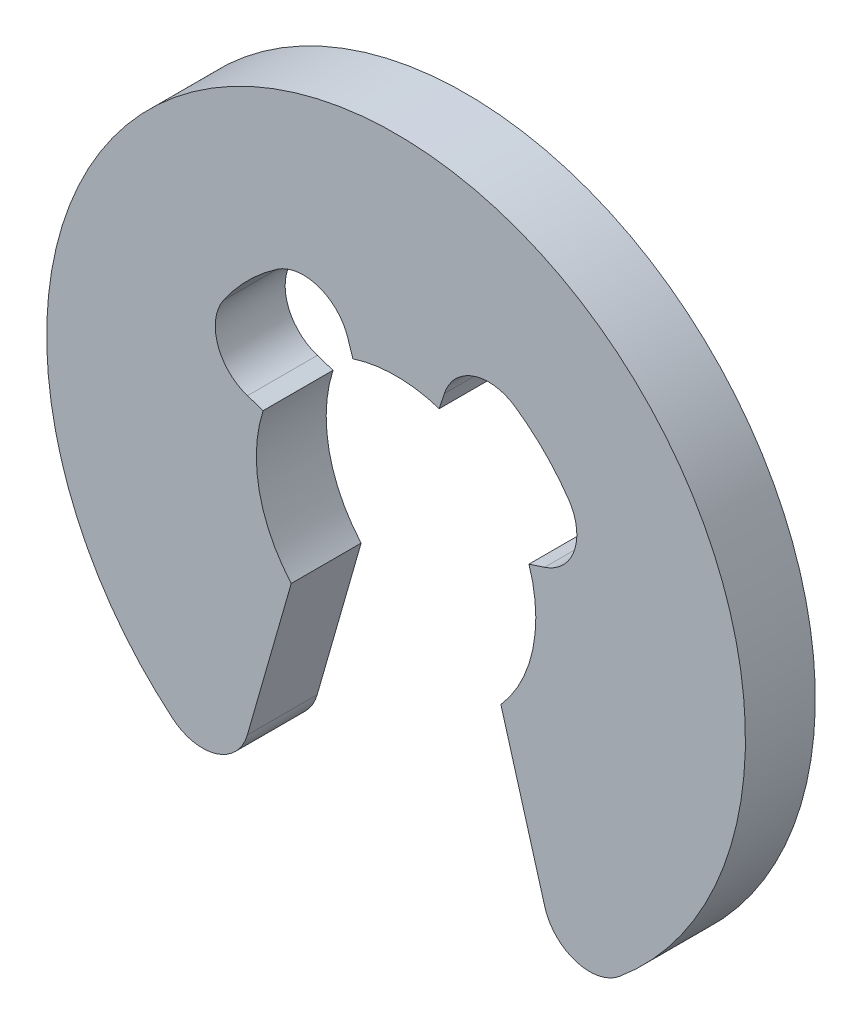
ISO-10303-21;
HEADER;
FILE_DESCRIPTION(('STEP AP214'),'2;1');
FILE_NAME('part.step','',(''),(''),'','','');
FILE_SCHEMA(('AUTOMOTIVE_DESIGN { 1 0 10303 214 1 1 1 1 }'));
ENDSEC;
DATA;
#1=APPLICATION_CONTEXT('core data for automotive mechanical design processes');
#2=APPLICATION_PROTOCOL_DEFINITION('international standard','automotive_design',2000,#1);
#3=PRODUCT_CONTEXT('',#1,'mechanical');
#4=PRODUCT('Part','Part','',(#3));
#5=PRODUCT_RELATED_PRODUCT_CATEGORY('part','',(#4));
#6=PRODUCT_DEFINITION_FORMATION('','',#4);
#7=PRODUCT_DEFINITION_CONTEXT('part definition',#1,'design');
#8=PRODUCT_DEFINITION('design','',#6,#7);
#9=PRODUCT_DEFINITION_SHAPE('','',#8);
#10=(LENGTH_UNIT() NAMED_UNIT(*) SI_UNIT(.MILLI.,.METRE.));
#11=(NAMED_UNIT(*) PLANE_ANGLE_UNIT() SI_UNIT($,.RADIAN.));
#12=(NAMED_UNIT(*) SI_UNIT($,.STERADIAN.) SOLID_ANGLE_UNIT());
#13=UNCERTAINTY_MEASURE_WITH_UNIT(LENGTH_MEASURE(1.E-05),#10,'distance_accuracy_value','');
#14=(GEOMETRIC_REPRESENTATION_CONTEXT(3) GLOBAL_UNCERTAINTY_ASSIGNED_CONTEXT((#13)) GLOBAL_UNIT_ASSIGNED_CONTEXT((#10,
#11,#12)) REPRESENTATION_CONTEXT('',''));
#15=CARTESIAN_POINT('',(0.,0.,0.));
#16=DIRECTION('',(0.,0.,1.));
#17=DIRECTION('',(1.,0.,0.));
#18=AXIS2_PLACEMENT_3D('',#15,#16,#17);
#19=CARTESIAN_POINT('',(0.57618470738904,0.397506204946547,-0.3));
#20=DIRECTION('',(0.,0.,1.));
#21=DIRECTION('',(1.,0.,0.));
#22=AXIS2_PLACEMENT_3D('',#19,#20,#21);
#23=CYLINDRICAL_SURFACE('',#22,0.2);
#24=CARTESIAN_POINT('',(0.57618470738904,0.397506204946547,0.));
#25=DIRECTION('',(0.,0.,-1.));
#26=DIRECTION('',(-1.,0.,0.));
#27=AXIS2_PLACEMENT_3D('',#24,#25,#26);
#28=CIRCLE('',#27,0.2);
#29=CARTESIAN_POINT('',(0.740808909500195,0.511079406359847,0.));
#30=VERTEX_POINT('',#29);
#31=CARTESIAN_POINT('',(0.63798810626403,0.207294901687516,0.));
#32=VERTEX_POINT('',#31);
#33=EDGE_CURVE('E190',#30,#32,#28,.T.);
#34=ORIENTED_EDGE('',*,*,#33,.F.);
#35=DIRECTION('',(0.,0.,1.));
#36=VECTOR('',#35,1.);
#37=CARTESIAN_POINT('',(0.740808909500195,0.511079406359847,-0.3));
#38=LINE('',#37,#36);
#39=CARTESIAN_POINT('',(0.740808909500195,0.511079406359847,-0.3));
#40=VERTEX_POINT('',#39);
#41=EDGE_CURVE('E11',#40,#30,#38,.T.);
#42=ORIENTED_EDGE('',*,*,#41,.F.);
#43=CARTESIAN_POINT('',(0.57618470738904,0.397506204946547,-0.3));
#44=DIRECTION('',(0.,0.,-1.));
#45=DIRECTION('',(-1.,0.,0.));
#46=AXIS2_PLACEMENT_3D('',#43,#44,#45);
#47=CIRCLE('',#46,0.2);
#48=CARTESIAN_POINT('',(0.63798810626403,0.207294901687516,-0.3));
#49=VERTEX_POINT('',#48);
#50=EDGE_CURVE('E240',#40,#49,#47,.T.);
#51=ORIENTED_EDGE('',*,*,#50,.T.);
#52=DIRECTION('',(0.,0.,1.));
#53=VECTOR('',#52,1.);
#54=CARTESIAN_POINT('',(0.63798810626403,0.207294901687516,-0.3));
#55=LINE('',#54,#53);
#56=EDGE_CURVE('E36',#49,#32,#55,.T.);
#57=ORIENTED_EDGE('',*,*,#56,.T.);
#58=EDGE_LOOP('',(#34,#42,#51,#57));
#59=FACE_BOUND('',#58,.T.);
#60=ADVANCED_FACE('F33',(#59),#23,.F.);
#61=CARTESIAN_POINT('',(0.,0.,-0.3));
#62=DIRECTION('',(0.,0.,1.));
#63=DIRECTION('',(1.,0.,0.));
#64=AXIS2_PLACEMENT_3D('',#61,#62,#63);
#65=CYLINDRICAL_SURFACE('',#64,0.900000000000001);
#66=CARTESIAN_POINT('',(0.,0.,0.));
#67=DIRECTION('',(0.,0.,-1.));
#68=DIRECTION('',(1.,0.,0.));
#69=AXIS2_PLACEMENT_3D('',#66,#67,#68);
#70=CIRCLE('',#69,0.900000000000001);
#71=CARTESIAN_POINT('',(0.511079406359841,0.740808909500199,0.));
#72=VERTEX_POINT('',#71);
#73=EDGE_CURVE('E238',#72,#30,#70,.T.);
#74=ORIENTED_EDGE('',*,*,#73,.F.);
#75=DIRECTION('',(0.,0.,1.));
#76=VECTOR('',#75,1.);
#77=CARTESIAN_POINT('',(0.511079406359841,0.740808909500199,-0.3));
#78=LINE('',#77,#76);
#79=CARTESIAN_POINT('',(0.511079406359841,0.740808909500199,-0.3));
#80=VERTEX_POINT('',#79);
#81=EDGE_CURVE('E42',#80,#72,#78,.T.);
#82=ORIENTED_EDGE('',*,*,#81,.F.);
#83=CARTESIAN_POINT('',(0.,0.,-0.3));
#84=DIRECTION('',(0.,0.,-1.));
#85=DIRECTION('',(1.,0.,0.));
#86=AXIS2_PLACEMENT_3D('',#83,#84,#85);
#87=CIRCLE('',#86,0.900000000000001);
#88=EDGE_CURVE('E180',#80,#40,#87,.T.);
#89=ORIENTED_EDGE('',*,*,#88,.T.);
#90=ORIENTED_EDGE('',*,*,#41,.T.);
#91=EDGE_LOOP('',(#74,#82,#89,#90));
#92=FACE_BOUND('',#91,.T.);
#93=ADVANCED_FACE('F272',(#92),#65,.F.);
#94=CARTESIAN_POINT('',(0.397506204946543,0.576184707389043,-0.3));
#95=DIRECTION('',(0.,0.,1.));
#96=DIRECTION('',(1.,0.,0.));
#97=AXIS2_PLACEMENT_3D('',#94,#95,#96);
#98=CYLINDRICAL_SURFACE('',#97,0.2);
#99=CARTESIAN_POINT('',(0.397506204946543,0.576184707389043,0.));
#100=DIRECTION('',(0.,0.,-1.));
#101=DIRECTION('',(-1.,0.,0.));
#102=AXIS2_PLACEMENT_3D('',#99,#100,#101);
#103=CIRCLE('',#102,0.2);
#104=CARTESIAN_POINT('',(0.207294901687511,0.637988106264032,0.));
#105=VERTEX_POINT('',#104);
#106=EDGE_CURVE('E167',#105,#72,#103,.T.);
#107=ORIENTED_EDGE('',*,*,#106,.F.);
#108=DIRECTION('',(0.,0.,1.));
#109=VECTOR('',#108,1.);
#110=CARTESIAN_POINT('',(0.207294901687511,0.637988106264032,-0.3));
#111=LINE('',#110,#109);
#112=CARTESIAN_POINT('',(0.207294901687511,0.637988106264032,-0.3));
#113=VERTEX_POINT('',#112);
#114=EDGE_CURVE('E162',#113,#105,#111,.T.);
#115=ORIENTED_EDGE('',*,*,#114,.F.);
#116=CARTESIAN_POINT('',(0.397506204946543,0.576184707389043,-0.3));
#117=DIRECTION('',(0.,0.,-1.));
#118=DIRECTION('',(-1.,0.,0.));
#119=AXIS2_PLACEMENT_3D('',#116,#117,#118);
#120=CIRCLE('',#119,0.2);
#121=EDGE_CURVE('E165',#113,#80,#120,.T.);
#122=ORIENTED_EDGE('',*,*,#121,.T.);
#123=ORIENTED_EDGE('',*,*,#81,.T.);
#124=EDGE_LOOP('',(#107,#115,#122,#123));
#125=FACE_BOUND('',#124,.T.);
#126=ADVANCED_FACE('F164',(#125),#98,.F.);
#127=CARTESIAN_POINT('',(0.207294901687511,0.637988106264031,-0.3));
#128=DIRECTION('',(0.951056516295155,-0.309016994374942,0.));
#129=DIRECTION('',(0.309016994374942,0.951056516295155,0.));
#130=AXIS2_PLACEMENT_3D('',#127,#128,#129);
#131=PLANE('',#130);
#132=DIRECTION('',(0.309016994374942,0.951056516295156,0.));
#133=VECTOR('',#132,1.);
#134=CARTESIAN_POINT('',(0.207294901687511,0.637988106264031,0.));
#135=LINE('',#134,#133);
#136=CARTESIAN_POINT('',(0.185410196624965,0.570633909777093,0.));
#137=VERTEX_POINT('',#136);
#138=EDGE_CURVE('E235',#137,#105,#135,.T.);
#139=ORIENTED_EDGE('',*,*,#138,.F.);
#140=DIRECTION('',(0.,0.,1.));
#141=VECTOR('',#140,1.);
#142=CARTESIAN_POINT('',(0.185410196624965,0.570633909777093,-0.3));
#143=LINE('',#142,#141);
#144=CARTESIAN_POINT('',(0.185410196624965,0.570633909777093,-0.3));
#145=VERTEX_POINT('',#144);
#146=EDGE_CURVE('E172',#145,#137,#143,.T.);
#147=ORIENTED_EDGE('',*,*,#146,.F.);
#148=DIRECTION('',(0.309016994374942,0.951056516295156,0.));
#149=VECTOR('',#148,1.);
#150=CARTESIAN_POINT('',(0.207294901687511,0.637988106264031,-0.3));
#151=LINE('',#150,#149);
#152=EDGE_CURVE('E178',#145,#113,#151,.T.);
#153=ORIENTED_EDGE('',*,*,#152,.T.);
#154=ORIENTED_EDGE('',*,*,#114,.T.);
#155=EDGE_LOOP('',(#139,#147,#153,#154));
#156=FACE_BOUND('',#155,.T.);
#157=ADVANCED_FACE('F182',(#156),#131,.T.);
#158=CARTESIAN_POINT('',(0.,0.,-0.3));
#159=DIRECTION('',(0.,0.,1.));
#160=DIRECTION('',(1.,0.,0.));
#161=AXIS2_PLACEMENT_3D('',#158,#159,#160);
#162=CYLINDRICAL_SURFACE('',#161,0.6);
#163=CARTESIAN_POINT('',(0.,0.,0.));
#164=DIRECTION('',(0.,0.,-1.));
#165=DIRECTION('',(1.,0.,0.));
#166=AXIS2_PLACEMENT_3D('',#163,#164,#165);
#167=CIRCLE('',#166,0.6);
#168=CARTESIAN_POINT('',(-0.185410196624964,0.570633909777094,0.));
#169=VERTEX_POINT('',#168);
#170=EDGE_CURVE('E232',#169,#137,#167,.T.);
#171=ORIENTED_EDGE('',*,*,#170,.F.);
#172=DIRECTION('',(0.,0.,1.));
#173=VECTOR('',#172,1.);
#174=CARTESIAN_POINT('',(-0.185410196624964,0.570633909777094,-0.3));
#175=LINE('',#174,#173);
#176=CARTESIAN_POINT('',(-0.185410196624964,0.570633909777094,-0.3));
#177=VERTEX_POINT('',#176);
#178=EDGE_CURVE('E244',#177,#169,#175,.T.);
#179=ORIENTED_EDGE('',*,*,#178,.F.);
#180=CARTESIAN_POINT('',(0.,0.,-0.3));
#181=DIRECTION('',(0.,0.,-1.));
#182=DIRECTION('',(1.,0.,0.));
#183=AXIS2_PLACEMENT_3D('',#180,#181,#182);
#184=CIRCLE('',#183,0.6);
#185=EDGE_CURVE('E183',#177,#145,#184,.T.);
#186=ORIENTED_EDGE('',*,*,#185,.T.);
#187=ORIENTED_EDGE('',*,*,#146,.T.);
#188=EDGE_LOOP('',(#171,#179,#186,#187));
#189=FACE_BOUND('',#188,.T.);
#190=ADVANCED_FACE('F285',(#189),#162,.F.);
#191=CARTESIAN_POINT('',(-0.207294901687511,0.637988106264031,-0.3));
#192=DIRECTION('',(-0.951056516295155,-0.309016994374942,0.));
#193=DIRECTION('',(0.309016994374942,-0.951056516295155,0.));
#194=AXIS2_PLACEMENT_3D('',#191,#192,#193);
#195=PLANE('',#194);
#196=DIRECTION('',(0.309016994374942,-0.951056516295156,0.));
#197=VECTOR('',#196,1.);
#198=CARTESIAN_POINT('',(-0.207294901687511,0.637988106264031,0.));
#199=LINE('',#198,#197);
#200=CARTESIAN_POINT('',(-0.207294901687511,0.637988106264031,0.));
#201=VERTEX_POINT('',#200);
#202=EDGE_CURVE('E229',#201,#169,#199,.T.);
#203=ORIENTED_EDGE('',*,*,#202,.F.);
#204=DIRECTION('',(0.,0.,1.));
#205=VECTOR('',#204,1.);
#206=CARTESIAN_POINT('',(-0.207294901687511,0.637988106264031,-0.3));
#207=LINE('',#206,#205);
#208=CARTESIAN_POINT('',(-0.207294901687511,0.637988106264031,-0.3));
#209=VERTEX_POINT('',#208);
#210=EDGE_CURVE('E246',#209,#201,#207,.T.);
#211=ORIENTED_EDGE('',*,*,#210,.F.);
#212=DIRECTION('',(0.309016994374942,-0.951056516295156,0.));
#213=VECTOR('',#212,1.);
#214=CARTESIAN_POINT('',(-0.207294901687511,0.637988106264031,-0.3));
#215=LINE('',#214,#213);
#216=EDGE_CURVE('E185',#209,#177,#215,.T.);
#217=ORIENTED_EDGE('',*,*,#216,.T.);
#218=ORIENTED_EDGE('',*,*,#178,.T.);
#219=EDGE_LOOP('',(#203,#211,#217,#218));
#220=FACE_BOUND('',#219,.T.);
#221=ADVANCED_FACE('F288',(#220),#195,.T.);
#222=CARTESIAN_POINT('',(-0.397506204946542,0.576184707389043,-0.3));
#223=DIRECTION('',(0.,0.,1.));
#224=DIRECTION('',(1.,0.,0.));
#225=AXIS2_PLACEMENT_3D('',#222,#223,#224);
#226=CYLINDRICAL_SURFACE('',#225,0.2);
#227=CARTESIAN_POINT('',(-0.397506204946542,0.576184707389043,0.));
#228=DIRECTION('',(0.,0.,-1.));
#229=DIRECTION('',(1.,0.,0.));
#230=AXIS2_PLACEMENT_3D('',#227,#228,#229);
#231=CIRCLE('',#230,0.2);
#232=CARTESIAN_POINT('',(-0.51107940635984,0.740808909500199,0.));
#233=VERTEX_POINT('',#232);
#234=EDGE_CURVE('E226',#233,#201,#231,.T.);
#235=ORIENTED_EDGE('',*,*,#234,.F.);
#236=DIRECTION('',(0.,0.,1.));
#237=VECTOR('',#236,1.);
#238=CARTESIAN_POINT('',(-0.51107940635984,0.740808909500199,-0.3));
#239=LINE('',#238,#237);
#240=CARTESIAN_POINT('',(-0.51107940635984,0.740808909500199,-0.3));
#241=VERTEX_POINT('',#240);
#242=EDGE_CURVE('E248',#241,#233,#239,.T.);
#243=ORIENTED_EDGE('',*,*,#242,.F.);
#244=CARTESIAN_POINT('',(-0.397506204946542,0.576184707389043,-0.3));
#245=DIRECTION('',(0.,0.,-1.));
#246=DIRECTION('',(1.,0.,0.));
#247=AXIS2_PLACEMENT_3D('',#244,#245,#246);
#248=CIRCLE('',#247,0.2);
#249=EDGE_CURVE('E496',#241,#209,#248,.T.);
#250=ORIENTED_EDGE('',*,*,#249,.T.);
#251=ORIENTED_EDGE('',*,*,#210,.T.);
#252=EDGE_LOOP('',(#235,#243,#250,#251));
#253=FACE_BOUND('',#252,.T.);
#254=ADVANCED_FACE('F292',(#253),#226,.F.);
#255=CARTESIAN_POINT('',(0.,0.,-0.3));
#256=DIRECTION('',(0.,0.,1.));
#257=DIRECTION('',(1.,0.,0.));
#258=AXIS2_PLACEMENT_3D('',#255,#256,#257);
#259=CYLINDRICAL_SURFACE('',#258,0.9);
#260=CARTESIAN_POINT('',(0.,0.,0.));
#261=DIRECTION('',(0.,0.,-1.));
#262=DIRECTION('',(-1.,0.,0.));
#263=AXIS2_PLACEMENT_3D('',#260,#261,#262);
#264=CIRCLE('',#263,0.9);
#265=CARTESIAN_POINT('',(-0.740808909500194,0.511079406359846,0.));
#266=VERTEX_POINT('',#265);
#267=EDGE_CURVE('E223',#266,#233,#264,.T.);
#268=ORIENTED_EDGE('',*,*,#267,.F.);
#269=DIRECTION('',(0.,0.,1.));
#270=VECTOR('',#269,1.);
#271=CARTESIAN_POINT('',(-0.740808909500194,0.511079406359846,-0.3));
#272=LINE('',#271,#270);
#273=CARTESIAN_POINT('',(-0.740808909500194,0.511079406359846,-0.3));
#274=VERTEX_POINT('',#273);
#275=EDGE_CURVE('E250',#274,#266,#272,.T.);
#276=ORIENTED_EDGE('',*,*,#275,.F.);
#277=CARTESIAN_POINT('',(0.,0.,-0.3));
#278=DIRECTION('',(0.,0.,-1.));
#279=DIRECTION('',(-1.,0.,0.));
#280=AXIS2_PLACEMENT_3D('',#277,#278,#279);
#281=CIRCLE('',#280,0.9);
#282=EDGE_CURVE('E500',#274,#241,#281,.T.);
#283=ORIENTED_EDGE('',*,*,#282,.T.);
#284=ORIENTED_EDGE('',*,*,#242,.T.);
#285=EDGE_LOOP('',(#268,#276,#283,#284));
#286=FACE_BOUND('',#285,.T.);
#287=ADVANCED_FACE('F296',(#286),#259,.F.);
#288=CARTESIAN_POINT('',(-0.57618470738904,0.397506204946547,-0.3));
#289=DIRECTION('',(0.,0.,1.));
#290=DIRECTION('',(1.,0.,0.));
#291=AXIS2_PLACEMENT_3D('',#288,#289,#290);
#292=CYLINDRICAL_SURFACE('',#291,0.2);
#293=CARTESIAN_POINT('',(-0.57618470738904,0.397506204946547,0.));
#294=DIRECTION('',(0.,0.,-1.));
#295=DIRECTION('',(1.,0.,0.));
#296=AXIS2_PLACEMENT_3D('',#293,#294,#295);
#297=CIRCLE('',#296,0.2);
#298=CARTESIAN_POINT('',(-0.637988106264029,0.207294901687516,0.));
#299=VERTEX_POINT('',#298);
#300=EDGE_CURVE('E220',#299,#266,#297,.T.);
#301=ORIENTED_EDGE('',*,*,#300,.F.);
#302=DIRECTION('',(0.,0.,1.));
#303=VECTOR('',#302,1.);
#304=CARTESIAN_POINT('',(-0.637988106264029,0.207294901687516,-0.3));
#305=LINE('',#304,#303);
#306=CARTESIAN_POINT('',(-0.637988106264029,0.207294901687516,-0.3));
#307=VERTEX_POINT('',#306);
#308=EDGE_CURVE('E252',#307,#299,#305,.T.);
#309=ORIENTED_EDGE('',*,*,#308,.F.);
#310=CARTESIAN_POINT('',(-0.57618470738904,0.397506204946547,-0.3));
#311=DIRECTION('',(0.,0.,-1.));
#312=DIRECTION('',(1.,0.,0.));
#313=AXIS2_PLACEMENT_3D('',#310,#311,#312);
#314=CIRCLE('',#313,0.2);
#315=EDGE_CURVE('E489',#307,#274,#314,.T.);
#316=ORIENTED_EDGE('',*,*,#315,.T.);
#317=ORIENTED_EDGE('',*,*,#275,.T.);
#318=EDGE_LOOP('',(#301,#309,#316,#317));
#319=FACE_BOUND('',#318,.T.);
#320=ADVANCED_FACE('F300',(#319),#292,.F.);
#321=CARTESIAN_POINT('',(-0.570633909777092,0.185410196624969,-0.3));
#322=DIRECTION('',(0.309016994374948,0.951056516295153,0.));
#323=DIRECTION('',(-0.951056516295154,0.309016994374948,0.));
#324=AXIS2_PLACEMENT_3D('',#321,#322,#323);
#325=PLANE('',#324);
#326=DIRECTION('',(-0.951056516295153,0.309016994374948,0.));
#327=VECTOR('',#326,1.);
#328=CARTESIAN_POINT('',(-0.570633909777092,0.185410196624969,0.));
#329=LINE('',#328,#327);
#330=CARTESIAN_POINT('',(-0.570633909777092,0.185410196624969,0.));
#331=VERTEX_POINT('',#330);
#332=EDGE_CURVE('E217',#331,#299,#329,.T.);
#333=ORIENTED_EDGE('',*,*,#332,.F.);
#334=DIRECTION('',(0.,0.,1.));
#335=VECTOR('',#334,1.);
#336=CARTESIAN_POINT('',(-0.570633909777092,0.185410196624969,-0.3));
#337=LINE('',#336,#335);
#338=CARTESIAN_POINT('',(-0.570633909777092,0.185410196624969,-0.3));
#339=VERTEX_POINT('',#338);
#340=EDGE_CURVE('E254',#339,#331,#337,.T.);
#341=ORIENTED_EDGE('',*,*,#340,.F.);
#342=DIRECTION('',(-0.951056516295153,0.309016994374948,0.));
#343=VECTOR('',#342,1.);
#344=CARTESIAN_POINT('',(-0.570633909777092,0.185410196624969,-0.3));
#345=LINE('',#344,#343);
#346=EDGE_CURVE('E485',#339,#307,#345,.T.);
#347=ORIENTED_EDGE('',*,*,#346,.T.);
#348=ORIENTED_EDGE('',*,*,#308,.T.);
#349=EDGE_LOOP('',(#333,#341,#347,#348));
#350=FACE_BOUND('',#349,.T.);
#351=ADVANCED_FACE('F304',(#350),#325,.T.);
#352=CARTESIAN_POINT('',(0.,0.,-0.3));
#353=DIRECTION('',(0.,0.,1.));
#354=DIRECTION('',(1.,0.,0.));
#355=AXIS2_PLACEMENT_3D('',#352,#353,#354);
#356=CYLINDRICAL_SURFACE('',#355,0.6);
#357=CARTESIAN_POINT('',(0.,0.,0.));
#358=DIRECTION('',(0.,0.,-1.));
#359=DIRECTION('',(-1.,0.,0.));
#360=AXIS2_PLACEMENT_3D('',#357,#358,#359);
#361=CIRCLE('',#360,0.6);
#362=CARTESIAN_POINT('',(-0.449999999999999,-0.396862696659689,0.));
#363=VERTEX_POINT('',#362);
#364=EDGE_CURVE('E214',#363,#331,#361,.T.);
#365=ORIENTED_EDGE('',*,*,#364,.F.);
#366=DIRECTION('',(0.,0.,1.));
#367=VECTOR('',#366,1.);
#368=CARTESIAN_POINT('',(-0.449999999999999,-0.396862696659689,-0.3));
#369=LINE('',#368,#367);
#370=CARTESIAN_POINT('',(-0.449999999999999,-0.396862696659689,-0.3));
#371=VERTEX_POINT('',#370);
#372=EDGE_CURVE('E256',#371,#363,#369,.T.);
#373=ORIENTED_EDGE('',*,*,#372,.F.);
#374=CARTESIAN_POINT('',(0.,0.,-0.3));
#375=DIRECTION('',(0.,0.,-1.));
#376=DIRECTION('',(-1.,0.,0.));
#377=AXIS2_PLACEMENT_3D('',#374,#375,#376);
#378=CIRCLE('',#377,0.6);
#379=EDGE_CURVE('E506',#371,#339,#378,.T.);
#380=ORIENTED_EDGE('',*,*,#379,.T.);
#381=ORIENTED_EDGE('',*,*,#340,.T.);
#382=EDGE_LOOP('',(#365,#373,#380,#381));
#383=FACE_BOUND('',#382,.T.);
#384=ADVANCED_FACE('F308',(#383),#356,.F.);
#385=CARTESIAN_POINT('',(-0.45,-0.396862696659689,-0.3));
#386=DIRECTION('',(0.961261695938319,-0.275637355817,0.));
#387=DIRECTION('',(0.275637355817,0.961261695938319,0.));
#388=AXIS2_PLACEMENT_3D('',#385,#386,#387);
#389=PLANE('',#388);
#390=DIRECTION('',(0.275637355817,0.961261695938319,0.));
#391=VECTOR('',#390,1.);
#392=CARTESIAN_POINT('',(-0.45,-0.396862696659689,0.));
#393=LINE('',#392,#391);
#394=CARTESIAN_POINT('',(-0.63868813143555,-1.05489641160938,0.));
#395=VERTEX_POINT('',#394);
#396=EDGE_CURVE('E211',#395,#363,#393,.T.);
#397=ORIENTED_EDGE('',*,*,#396,.F.);
#398=DIRECTION('',(0.,0.,1.));
#399=VECTOR('',#398,1.);
#400=CARTESIAN_POINT('',(-0.63868813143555,-1.05489641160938,-0.3));
#401=LINE('',#400,#399);
#402=CARTESIAN_POINT('',(-0.63868813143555,-1.05489641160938,-0.3));
#403=VERTEX_POINT('',#402);
#404=EDGE_CURVE('E258',#403,#395,#401,.T.);
#405=ORIENTED_EDGE('',*,*,#404,.F.);
#406=DIRECTION('',(0.275637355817,0.961261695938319,0.));
#407=VECTOR('',#406,1.);
#408=CARTESIAN_POINT('',(-0.45,-0.396862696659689,-0.3));
#409=LINE('',#408,#407);
#410=EDGE_CURVE('E478',#403,#371,#409,.T.);
#411=ORIENTED_EDGE('',*,*,#410,.T.);
#412=ORIENTED_EDGE('',*,*,#372,.T.);
#413=EDGE_LOOP('',(#397,#405,#411,#412));
#414=FACE_BOUND('',#413,.T.);
#415=ADVANCED_FACE('F312',(#414),#389,.T.);
#416=CARTESIAN_POINT('',(-0.830940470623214,-0.999768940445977,-0.3));
#417=DIRECTION('',(0.,0.,1.));
#418=DIRECTION('',(1.,0.,0.));
#419=AXIS2_PLACEMENT_3D('',#416,#417,#418);
#420=CYLINDRICAL_SURFACE('',#419,0.2);
#421=CARTESIAN_POINT('',(-0.830940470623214,-0.999768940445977,0.));
#422=DIRECTION('',(0.,0.,1.));
#423=DIRECTION('',(-1.,0.,0.));
#424=AXIS2_PLACEMENT_3D('',#421,#422,#423);
#425=CIRCLE('',#424,0.2);
#426=CARTESIAN_POINT('',(-0.958777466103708,-1.15357954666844,0.));
#427=VERTEX_POINT('',#426);
#428=EDGE_CURVE('E208',#427,#395,#425,.T.);
#429=ORIENTED_EDGE('',*,*,#428,.F.);
#430=DIRECTION('',(0.,0.,1.));
#431=VECTOR('',#430,1.);
#432=CARTESIAN_POINT('',(-0.958777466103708,-1.15357954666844,-0.3));
#433=LINE('',#432,#431);
#434=CARTESIAN_POINT('',(-0.958777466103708,-1.15357954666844,-0.3));
#435=VERTEX_POINT('',#434);
#436=EDGE_CURVE('E260',#435,#427,#433,.T.);
#437=ORIENTED_EDGE('',*,*,#436,.F.);
#438=CARTESIAN_POINT('',(-0.830940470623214,-0.999768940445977,-0.3));
#439=DIRECTION('',(0.,0.,1.));
#440=DIRECTION('',(-1.,0.,0.));
#441=AXIS2_PLACEMENT_3D('',#438,#439,#440);
#442=CIRCLE('',#441,0.2);
#443=EDGE_CURVE('E474',#435,#403,#442,.T.);
#444=ORIENTED_EDGE('',*,*,#443,.T.);
#445=ORIENTED_EDGE('',*,*,#404,.T.);
#446=EDGE_LOOP('',(#429,#437,#444,#445));
#447=FACE_BOUND('',#446,.T.);
#448=ADVANCED_FACE('F316',(#447),#420,.T.);
#449=CARTESIAN_POINT('',(0.,0.,-0.3));
#450=DIRECTION('',(0.,0.,1.));
#451=DIRECTION('',(1.,0.,0.));
#452=AXIS2_PLACEMENT_3D('',#449,#450,#451);
#453=CYLINDRICAL_SURFACE('',#452,1.5);
#454=CARTESIAN_POINT('',(0.,0.,0.));
#455=DIRECTION('',(0.,0.,1.));
#456=DIRECTION('',(1.,0.,0.));
#457=AXIS2_PLACEMENT_3D('',#454,#455,#456);
#458=CIRCLE('',#457,1.5);
#459=CARTESIAN_POINT('',(0.958777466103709,-1.15357954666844,0.));
#460=VERTEX_POINT('',#459);
#461=EDGE_CURVE('E205',#460,#427,#458,.T.);
#462=ORIENTED_EDGE('',*,*,#461,.F.);
#463=DIRECTION('',(0.,0.,1.));
#464=VECTOR('',#463,1.);
#465=CARTESIAN_POINT('',(0.958777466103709,-1.15357954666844,-0.3));
#466=LINE('',#465,#464);
#467=CARTESIAN_POINT('',(0.958777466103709,-1.15357954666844,-0.3));
#468=VERTEX_POINT('',#467);
#469=EDGE_CURVE('E262',#468,#460,#466,.T.);
#470=ORIENTED_EDGE('',*,*,#469,.F.);
#471=CARTESIAN_POINT('',(0.,0.,-0.3));
#472=DIRECTION('',(0.,0.,1.));
#473=DIRECTION('',(1.,0.,0.));
#474=AXIS2_PLACEMENT_3D('',#471,#472,#473);
#475=CIRCLE('',#474,1.5);
#476=EDGE_CURVE('E510',#468,#435,#475,.T.);
#477=ORIENTED_EDGE('',*,*,#476,.T.);
#478=ORIENTED_EDGE('',*,*,#436,.T.);
#479=EDGE_LOOP('',(#462,#470,#477,#478));
#480=FACE_BOUND('',#479,.T.);
#481=ADVANCED_FACE('F320',(#480),#453,.T.);
#482=CARTESIAN_POINT('',(0.830940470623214,-0.999768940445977,-0.3));
#483=DIRECTION('',(0.,0.,1.));
#484=DIRECTION('',(1.,0.,0.));
#485=AXIS2_PLACEMENT_3D('',#482,#483,#484);
#486=CYLINDRICAL_SURFACE('',#485,0.2);
#487=CARTESIAN_POINT('',(0.830940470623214,-0.999768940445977,0.));
#488=DIRECTION('',(0.,0.,1.));
#489=DIRECTION('',(1.,0.,0.));
#490=AXIS2_PLACEMENT_3D('',#487,#488,#489);
#491=CIRCLE('',#490,0.2);
#492=CARTESIAN_POINT('',(0.63868813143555,-1.05489641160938,0.));
#493=VERTEX_POINT('',#492);
#494=EDGE_CURVE('E202',#493,#460,#491,.T.);
#495=ORIENTED_EDGE('',*,*,#494,.F.);
#496=DIRECTION('',(0.,0.,1.));
#497=VECTOR('',#496,1.);
#498=CARTESIAN_POINT('',(0.63868813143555,-1.05489641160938,-0.3));
#499=LINE('',#498,#497);
#500=CARTESIAN_POINT('',(0.63868813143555,-1.05489641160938,-0.3));
#501=VERTEX_POINT('',#500);
#502=EDGE_CURVE('E264',#501,#493,#499,.T.);
#503=ORIENTED_EDGE('',*,*,#502,.F.);
#504=CARTESIAN_POINT('',(0.830940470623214,-0.999768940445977,-0.3));
#505=DIRECTION('',(0.,0.,1.));
#506=DIRECTION('',(1.,0.,0.));
#507=AXIS2_PLACEMENT_3D('',#504,#505,#506);
#508=CIRCLE('',#507,0.2);
#509=EDGE_CURVE('E467',#501,#468,#508,.T.);
#510=ORIENTED_EDGE('',*,*,#509,.T.);
#511=ORIENTED_EDGE('',*,*,#469,.T.);
#512=EDGE_LOOP('',(#495,#503,#510,#511));
#513=FACE_BOUND('',#512,.T.);
#514=ADVANCED_FACE('F324',(#513),#486,.T.);
#515=CARTESIAN_POINT('',(0.45,-0.396862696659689,-0.3));
#516=DIRECTION('',(-0.961261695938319,-0.275637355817,0.));
#517=DIRECTION('',(0.275637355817,-0.961261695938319,0.));
#518=AXIS2_PLACEMENT_3D('',#515,#516,#517);
#519=PLANE('',#518);
#520=DIRECTION('',(0.275637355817,-0.961261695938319,0.));
#521=VECTOR('',#520,1.);
#522=CARTESIAN_POINT('',(0.45,-0.396862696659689,0.));
#523=LINE('',#522,#521);
#524=CARTESIAN_POINT('',(0.45,-0.396862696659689,0.));
#525=VERTEX_POINT('',#524);
#526=EDGE_CURVE('E199',#525,#493,#523,.T.);
#527=ORIENTED_EDGE('',*,*,#526,.F.);
#528=DIRECTION('',(0.,0.,1.));
#529=VECTOR('',#528,1.);
#530=CARTESIAN_POINT('',(0.45,-0.396862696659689,-0.3));
#531=LINE('',#530,#529);
#532=CARTESIAN_POINT('',(0.45,-0.396862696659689,-0.3));
#533=VERTEX_POINT('',#532);
#534=EDGE_CURVE('E266',#533,#525,#531,.T.);
#535=ORIENTED_EDGE('',*,*,#534,.F.);
#536=DIRECTION('',(0.275637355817,-0.961261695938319,0.));
#537=VECTOR('',#536,1.);
#538=CARTESIAN_POINT('',(0.45,-0.396862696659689,-0.3));
#539=LINE('',#538,#537);
#540=EDGE_CURVE('E463',#533,#501,#539,.T.);
#541=ORIENTED_EDGE('',*,*,#540,.T.);
#542=ORIENTED_EDGE('',*,*,#502,.T.);
#543=EDGE_LOOP('',(#527,#535,#541,#542));
#544=FACE_BOUND('',#543,.T.);
#545=ADVANCED_FACE('F328',(#544),#519,.T.);
#546=CARTESIAN_POINT('',(0.,0.,-0.3));
#547=DIRECTION('',(0.,0.,1.));
#548=DIRECTION('',(1.,0.,0.));
#549=AXIS2_PLACEMENT_3D('',#546,#547,#548);
#550=CYLINDRICAL_SURFACE('',#549,0.600000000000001);
#551=CARTESIAN_POINT('',(0.,0.,0.));
#552=DIRECTION('',(0.,0.,-1.));
#553=DIRECTION('',(1.,0.,0.));
#554=AXIS2_PLACEMENT_3D('',#551,#552,#553);
#555=CIRCLE('',#554,0.600000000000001);
#556=CARTESIAN_POINT('',(0.570633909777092,0.185410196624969,0.));
#557=VERTEX_POINT('',#556);
#558=EDGE_CURVE('E196',#557,#525,#555,.T.);
#559=ORIENTED_EDGE('',*,*,#558,.F.);
#560=DIRECTION('',(0.,0.,1.));
#561=VECTOR('',#560,1.);
#562=CARTESIAN_POINT('',(0.570633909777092,0.185410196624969,-0.3));
#563=LINE('',#562,#561);
#564=CARTESIAN_POINT('',(0.570633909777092,0.185410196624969,-0.3));
#565=VERTEX_POINT('',#564);
#566=EDGE_CURVE('E267',#565,#557,#563,.T.);
#567=ORIENTED_EDGE('',*,*,#566,.F.);
#568=CARTESIAN_POINT('',(0.,0.,-0.3));
#569=DIRECTION('',(0.,0.,-1.));
#570=DIRECTION('',(1.,0.,0.));
#571=AXIS2_PLACEMENT_3D('',#568,#569,#570);
#572=CIRCLE('',#571,0.600000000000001);
#573=EDGE_CURVE('E514',#565,#533,#572,.T.);
#574=ORIENTED_EDGE('',*,*,#573,.T.);
#575=ORIENTED_EDGE('',*,*,#534,.T.);
#576=EDGE_LOOP('',(#559,#567,#574,#575));
#577=FACE_BOUND('',#576,.T.);
#578=ADVANCED_FACE('F332',(#577),#550,.F.);
#579=CARTESIAN_POINT('',(0.570633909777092,0.185410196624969,-0.3));
#580=DIRECTION('',(-0.309016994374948,0.951056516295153,0.));
#581=DIRECTION('',(-0.951056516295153,-0.309016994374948,0.));
#582=AXIS2_PLACEMENT_3D('',#579,#580,#581);
#583=PLANE('',#582);
#584=DIRECTION('',(-0.951056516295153,-0.309016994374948,0.));
#585=VECTOR('',#584,1.);
#586=CARTESIAN_POINT('',(0.570633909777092,0.185410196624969,0.));
#587=LINE('',#586,#585);
#588=EDGE_CURVE('E193',#32,#557,#587,.T.);
#589=ORIENTED_EDGE('',*,*,#588,.F.);
#590=ORIENTED_EDGE('',*,*,#56,.F.);
#591=DIRECTION('',(-0.951056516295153,-0.309016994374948,0.));
#592=VECTOR('',#591,1.);
#593=CARTESIAN_POINT('',(0.570633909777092,0.185410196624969,-0.3));
#594=LINE('',#593,#592);
#595=EDGE_CURVE('E516',#49,#565,#594,.T.);
#596=ORIENTED_EDGE('',*,*,#595,.T.);
#597=ORIENTED_EDGE('',*,*,#566,.T.);
#598=EDGE_LOOP('',(#589,#590,#596,#597));
#599=FACE_BOUND('',#598,.T.);
#600=ADVANCED_FACE('F269',(#599),#583,.T.);
#601=CARTESIAN_POINT('',(0.57618470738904,0.397506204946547,-0.3));
#602=DIRECTION('',(0.,0.,-1.));
#603=DIRECTION('',(-1.,0.,0.));
#604=AXIS2_PLACEMENT_3D('',#601,#602,#603);
#605=PLANE('',#604);
#606=ORIENTED_EDGE('',*,*,#50,.F.);
#607=ORIENTED_EDGE('',*,*,#88,.F.);
#608=ORIENTED_EDGE('',*,*,#121,.F.);
#609=ORIENTED_EDGE('',*,*,#152,.F.);
#610=ORIENTED_EDGE('',*,*,#185,.F.);
#611=ORIENTED_EDGE('',*,*,#216,.F.);
#612=ORIENTED_EDGE('',*,*,#249,.F.);
#613=ORIENTED_EDGE('',*,*,#282,.F.);
#614=ORIENTED_EDGE('',*,*,#315,.F.);
#615=ORIENTED_EDGE('',*,*,#346,.F.);
#616=ORIENTED_EDGE('',*,*,#379,.F.);
#617=ORIENTED_EDGE('',*,*,#410,.F.);
#618=ORIENTED_EDGE('',*,*,#443,.F.);
#619=ORIENTED_EDGE('',*,*,#476,.F.);
#620=ORIENTED_EDGE('',*,*,#509,.F.);
#621=ORIENTED_EDGE('',*,*,#540,.F.);
#622=ORIENTED_EDGE('',*,*,#573,.F.);
#623=ORIENTED_EDGE('',*,*,#595,.F.);
#624=EDGE_LOOP('',(#606,#607,#608,#609,#610,#611,#612,#613,#614,#615,#616,#617,#618,#619,#620,
#621,#622,#623));
#625=FACE_BOUND('',#624,.T.);
#626=ADVANCED_FACE('F176',(#625),#605,.T.);
#627=CARTESIAN_POINT('',(0.57618470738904,0.397506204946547,0.));
#628=DIRECTION('',(0.,0.,-1.));
#629=DIRECTION('',(-1.,0.,0.));
#630=AXIS2_PLACEMENT_3D('',#627,#628,#629);
#631=PLANE('',#630);
#632=ORIENTED_EDGE('',*,*,#33,.T.);
#633=ORIENTED_EDGE('',*,*,#588,.T.);
#634=ORIENTED_EDGE('',*,*,#558,.T.);
#635=ORIENTED_EDGE('',*,*,#526,.T.);
#636=ORIENTED_EDGE('',*,*,#494,.T.);
#637=ORIENTED_EDGE('',*,*,#461,.T.);
#638=ORIENTED_EDGE('',*,*,#428,.T.);
#639=ORIENTED_EDGE('',*,*,#396,.T.);
#640=ORIENTED_EDGE('',*,*,#364,.T.);
#641=ORIENTED_EDGE('',*,*,#332,.T.);
#642=ORIENTED_EDGE('',*,*,#300,.T.);
#643=ORIENTED_EDGE('',*,*,#267,.T.);
#644=ORIENTED_EDGE('',*,*,#234,.T.);
#645=ORIENTED_EDGE('',*,*,#202,.T.);
#646=ORIENTED_EDGE('',*,*,#170,.T.);
#647=ORIENTED_EDGE('',*,*,#138,.T.);
#648=ORIENTED_EDGE('',*,*,#106,.T.);
#649=ORIENTED_EDGE('',*,*,#73,.T.);
#650=EDGE_LOOP('',(#632,#633,#634,#635,#636,#637,#638,#639,#640,#641,#642,#643,#644,#645,#646,
#647,#648,#649));
#651=FACE_BOUND('',#650,.T.);
#652=ADVANCED_FACE('F271',(#651),#631,.F.);
#653=CLOSED_SHELL('',(#60,#93,#126,#157,#190,#221,#254,#287,#320,#351,#384,#415,#448,#481,#514,
#545,#578,#600,#626,#652));
#654=MANIFOLD_SOLID_BREP('B2',#653);
#655=ADVANCED_BREP_SHAPE_REPRESENTATION('',(#18,#654),#14);
#656=SHAPE_DEFINITION_REPRESENTATION(#9,#655);
ENDSEC;
END-ISO-10303-21;
